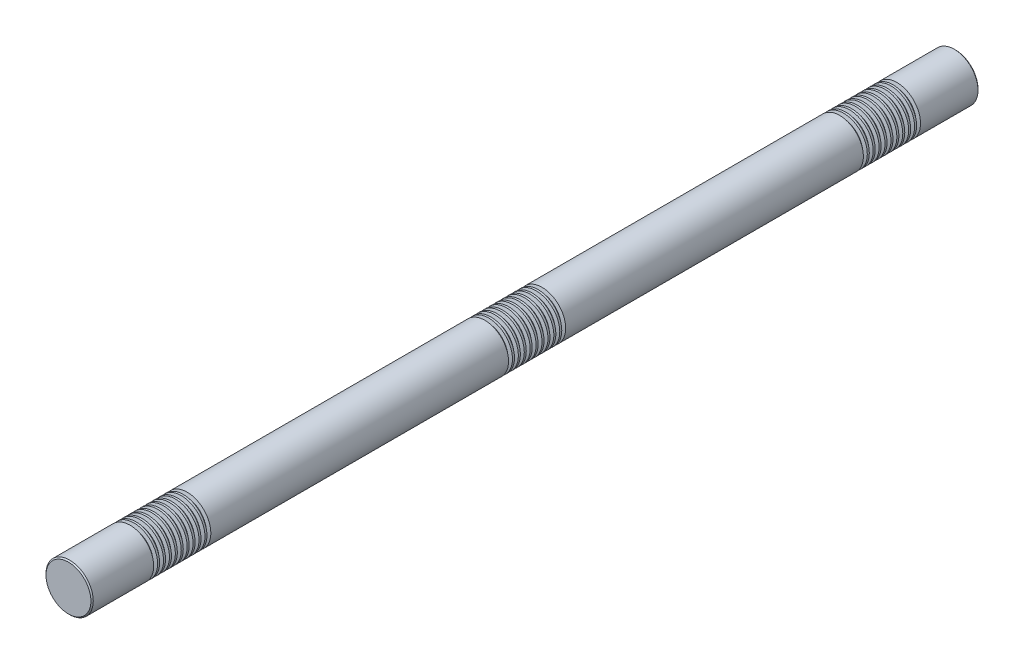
from build123d import *

# Parameters (mm, degrees)
SKETCH1_R           = 40
BOSS_EXTRUDE1_DEPTH = 750
CHAMFER1_SIZE       = 2
LPATTERN1_COUNT     = 10
LPATTERN1_PITCH     = 10
LPATTERN2_COUNT     = 3
LPATTERN2_PITCH     = 600


with BuildPart() as part:
    # Sketch1 → Boss-Extrude1 (new, symmetric)
    with BuildSketch(Plane.XY):
        Circle(SKETCH1_R)
    extrude(amount=BOSS_EXTRUDE1_DEPTH, both=True)

    # Chamfer1
    chamfer1_edges = [part.edges().sort_by_distance(p)[0] for p in [
        (-40, 0, -750),
        (-40, 0, 750),
    ]]
    chamfer(chamfer1_edges, length=CHAMFER1_SIZE)

    # Sketch2 → Cut-Revolve1 (revolve, cut)
    with BuildSketch(Plane(origin=(0, 0, 0), x_dir=(0, 0, -1), z_dir=(1, 0, 0)), mode=Mode.PRIVATE) as cut_revolve1_sk:
        Polygon((650.803847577, 40), (644.196152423, 40), (645.803847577, 34), (649.196152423, 34), align=None)
    cut_revolve1 = revolve(cut_revolve1_sk.sketch.rotate(Axis((0, 0, 750), (0, 0, -1)), 90), axis=Axis((0, 0, 750), (0, 0, -1)), mode=Mode.SUBTRACT)

    # LPattern1: Cut-Revolve1 ×10
    with Locations(*[(0, 0, i * LPATTERN1_PITCH) for i in range(1, LPATTERN1_COUNT)]):
        add(cut_revolve1, mode=Mode.SUBTRACT)

    # LPattern2: Cut-Revolve1 ×3
    with Locations(*[(0, 0, i * LPATTERN2_PITCH) for i in range(1, LPATTERN2_COUNT)]):
        add(cut_revolve1, mode=Mode.SUBTRACT)

    # LPattern2 copy 1 sketch → LPattern2 copy 1 (revolve, cut)
    with BuildSketch(Plane(origin=(0, 0, 610), x_dir=(0, 0, -1), z_dir=(1, 0, 0))):
        Polygon((650.803847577, 40), (644.196152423, 40), (645.803847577, 34), (649.196152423, 34), align=None)
    revolve(axis=Axis((0, 0, 1360), (0, 0, -1)), mode=Mode.SUBTRACT)

    # LPattern2 copy 2 sketch → LPattern2 copy 2 (revolve, cut)
    with BuildSketch(Plane(origin=(0, 0, 1210), x_dir=(0, 0, -1), z_dir=(1, 0, 0))):
        Polygon((650.803847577, 40), (644.196152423, 40), (645.803847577, 34), (649.196152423, 34), align=None)
    revolve(axis=Axis((0, 0, 1960), (0, 0, -1)), mode=Mode.SUBTRACT)

    # LPattern2 copy 3 sketch → LPattern2 copy 3 (revolve, cut)
    with BuildSketch(Plane(origin=(0, 0, 620), x_dir=(0, 0, -1), z_dir=(1, 0, 0))):
        Polygon((650.803847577, 40), (644.196152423, 40), (645.803847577, 34), (649.196152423, 34), align=None)
    revolve(axis=Axis((0, 0, 1370), (0, 0, -1)), mode=Mode.SUBTRACT)

    # LPattern2 copy 4 sketch → LPattern2 copy 4 (revolve, cut)
    with BuildSketch(Plane(origin=(0, 0, 1220), x_dir=(0, 0, -1), z_dir=(1, 0, 0))):
        Polygon((650.803847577, 40), (644.196152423, 40), (645.803847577, 34), (649.196152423, 34), align=None)
    revolve(axis=Axis((0, 0, 1970), (0, 0, -1)), mode=Mode.SUBTRACT)

    # LPattern2 copy 5 sketch → LPattern2 copy 5 (revolve, cut)
    with BuildSketch(Plane(origin=(0, 0, 630), x_dir=(0, 0, -1), z_dir=(1, 0, 0))):
        Polygon((650.803847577, 40), (644.196152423, 40), (645.803847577, 34), (649.196152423, 34), align=None)
    revolve(axis=Axis((0, 0, 1380), (0, 0, -1)), mode=Mode.SUBTRACT)

    # LPattern2 copy 6 sketch → LPattern2 copy 6 (revolve, cut)
    with BuildSketch(Plane(origin=(0, 0, 1230), x_dir=(0, 0, -1), z_dir=(1, 0, 0))):
        Polygon((650.803847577, 40), (644.196152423, 40), (645.803847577, 34), (649.196152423, 34), align=None)
    revolve(axis=Axis((0, 0, 1980), (0, 0, -1)), mode=Mode.SUBTRACT)

    # LPattern2 copy 7 sketch → LPattern2 copy 7 (revolve, cut)
    with BuildSketch(Plane(origin=(0, 0, 640), x_dir=(0, 0, -1), z_dir=(1, 0, 0))):
        Polygon((650.803847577, 40), (644.196152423, 40), (645.803847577, 34), (649.196152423, 34), align=None)
    revolve(axis=Axis((0, 0, 1390), (0, 0, -1)), mode=Mode.SUBTRACT)

    # LPattern2 copy 8 sketch → LPattern2 copy 8 (revolve, cut)
    with BuildSketch(Plane(origin=(0, 0, 1240), x_dir=(0, 0, -1), z_dir=(1, 0, 0))):
        Polygon((650.803847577, 40), (644.196152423, 40), (645.803847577, 34), (649.196152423, 34), align=None)
    revolve(axis=Axis((0, 0, 1990), (0, 0, -1)), mode=Mode.SUBTRACT)

    # LPattern2 copy 9 sketch → LPattern2 copy 9 (revolve, cut)
    with BuildSketch(Plane(origin=(0, 0, 650), x_dir=(0, 0, -1), z_dir=(1, 0, 0))):
        Polygon((650.803847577, 40), (644.196152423, 40), (645.803847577, 34), (649.196152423, 34), align=None)
    revolve(axis=Axis((0, 0, 1400), (0, 0, -1)), mode=Mode.SUBTRACT)

    # LPattern2 copy 10 sketch → LPattern2 copy 10 (revolve, cut)
    with BuildSketch(Plane(origin=(0, 0, 1250), x_dir=(0, 0, -1), z_dir=(1, 0, 0))):
        Polygon((650.803847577, 40), (644.196152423, 40), (645.803847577, 34), (649.196152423, 34), align=None)
    revolve(axis=Axis((0, 0, 2000), (0, 0, -1)), mode=Mode.SUBTRACT)

    # LPattern2 copy 11 sketch → LPattern2 copy 11 (revolve, cut)
    with BuildSketch(Plane(origin=(0, 0, 660), x_dir=(0, 0, -1), z_dir=(1, 0, 0))):
        Polygon((650.803847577, 40), (644.196152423, 40), (645.803847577, 34), (649.196152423, 34), align=None)
    revolve(axis=Axis((0, 0, 1410), (0, 0, -1)), mode=Mode.SUBTRACT)

    # LPattern2 copy 12 sketch → LPattern2 copy 12 (revolve, cut)
    with BuildSketch(Plane(origin=(0, 0, 1260), x_dir=(0, 0, -1), z_dir=(1, 0, 0))):
        Polygon((650.803847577, 40), (644.196152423, 40), (645.803847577, 34), (649.196152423, 34), align=None)
    revolve(axis=Axis((0, 0, 2010), (0, 0, -1)), mode=Mode.SUBTRACT)

    # LPattern2 copy 13 sketch → LPattern2 copy 13 (revolve, cut)
    with BuildSketch(Plane(origin=(0, 0, 670), x_dir=(0, 0, -1), z_dir=(1, 0, 0))):
        Polygon((650.803847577, 40), (644.196152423, 40), (645.803847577, 34), (649.196152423, 34), align=None)
    revolve(axis=Axis((0, 0, 1420), (0, 0, -1)), mode=Mode.SUBTRACT)

    # LPattern2 copy 14 sketch → LPattern2 copy 14 (revolve, cut)
    with BuildSketch(Plane(origin=(0, 0, 1270), x_dir=(0, 0, -1), z_dir=(1, 0, 0))):
        Polygon((650.803847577, 40), (644.196152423, 40), (645.803847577, 34), (649.196152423, 34), align=None)
    revolve(axis=Axis((0, 0, 2020), (0, 0, -1)), mode=Mode.SUBTRACT)

    # LPattern2 copy 15 sketch → LPattern2 copy 15 (revolve, cut)
    with BuildSketch(Plane(origin=(0, 0, 680), x_dir=(0, 0, -1), z_dir=(1, 0, 0))):
        Polygon((650.803847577, 40), (644.196152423, 40), (645.803847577, 34), (649.196152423, 34), align=None)
    revolve(axis=Axis((0, 0, 1430), (0, 0, -1)), mode=Mode.SUBTRACT)

    # LPattern2 copy 16 sketch → LPattern2 copy 16 (revolve, cut)
    with BuildSketch(Plane(origin=(0, 0, 1280), x_dir=(0, 0, -1), z_dir=(1, 0, 0))):
        Polygon((650.803847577, 40), (644.196152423, 40), (645.803847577, 34), (649.196152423, 34), align=None)
    revolve(axis=Axis((0, 0, 2030), (0, 0, -1)), mode=Mode.SUBTRACT)

    # LPattern2 copy 17 sketch → LPattern2 copy 17 (revolve, cut)
    with BuildSketch(Plane(origin=(0, 0, 690), x_dir=(0, 0, -1), z_dir=(1, 0, 0))):
        Polygon((650.803847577, 40), (644.196152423, 40), (645.803847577, 34), (649.196152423, 34), align=None)
    revolve(axis=Axis((0, 0, 1440), (0, 0, -1)), mode=Mode.SUBTRACT)

    # LPattern2 copy 18 sketch → LPattern2 copy 18 (revolve, cut)
    with BuildSketch(Plane(origin=(0, 0, 1290), x_dir=(0, 0, -1), z_dir=(1, 0, 0))):
        Polygon((650.803847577, 40), (644.196152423, 40), (645.803847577, 34), (649.196152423, 34), align=None)
    revolve(axis=Axis((0, 0, 2040), (0, 0, -1)), mode=Mode.SUBTRACT)


solid = part.part
